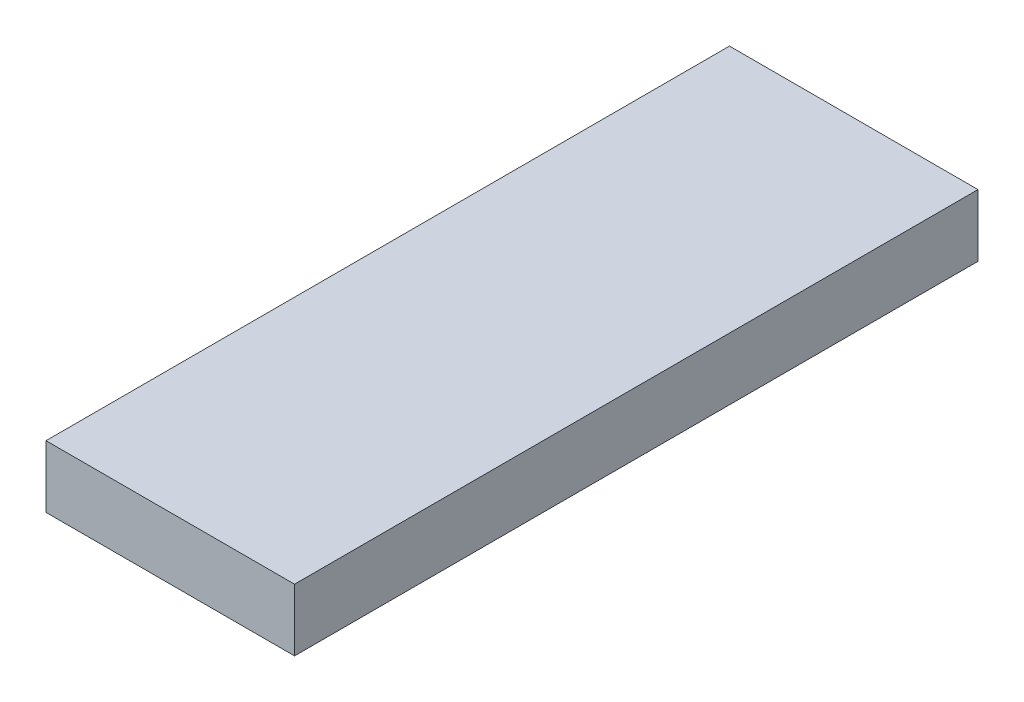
from build123d import *

# Parameters (mm, degrees)
SKETCH1_W           = 50.8
SKETCH1_H           = 139.7
BOSS_EXTRUDE1_DEPTH = 12.7


with BuildPart() as part:
    # Sketch1 → Boss-Extrude1 (new body)
    with BuildSketch(Plane(origin=(0, 0, 0), x_dir=(1, 0, 0), z_dir=(0, 1, 0))):
        with Locations((25.4, 69.85)):
            Rectangle(SKETCH1_W, SKETCH1_H)
    extrude(amount=BOSS_EXTRUDE1_DEPTH)


solid = part.part
